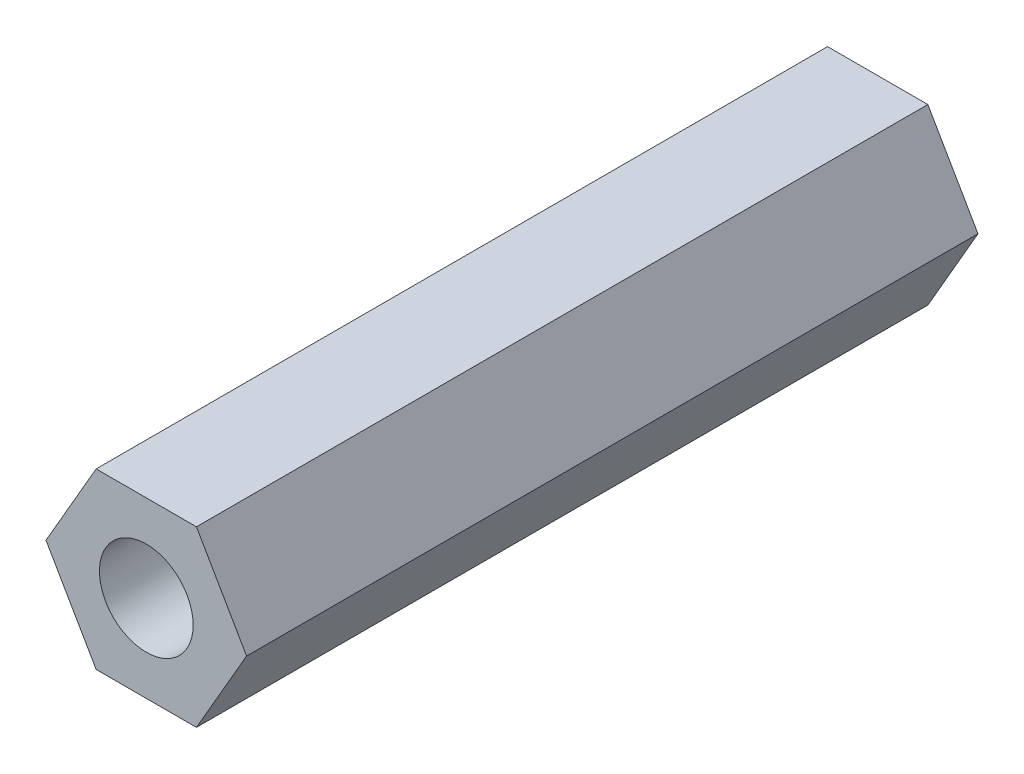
from build123d import *

# Parameters (mm, degrees)
ESQUISSE1_R          = 5.125
BASE_EXTRUSION_DEPTH = 80


with BuildPart() as part:
    # Esquisse1 → Base-Extrusion (new body)
    with BuildSketch(Plane.XY):
        Polygon((5.484827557, -9.5), (10.969655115, 0), (5.484827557, 9.5), (-5.484827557, 9.5), (-10.969655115, 0), (-5.484827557, -9.5), align=None)
        Circle(ESQUISSE1_R, mode=Mode.SUBTRACT)
    extrude(amount=BASE_EXTRUSION_DEPTH)


solid = part.part
